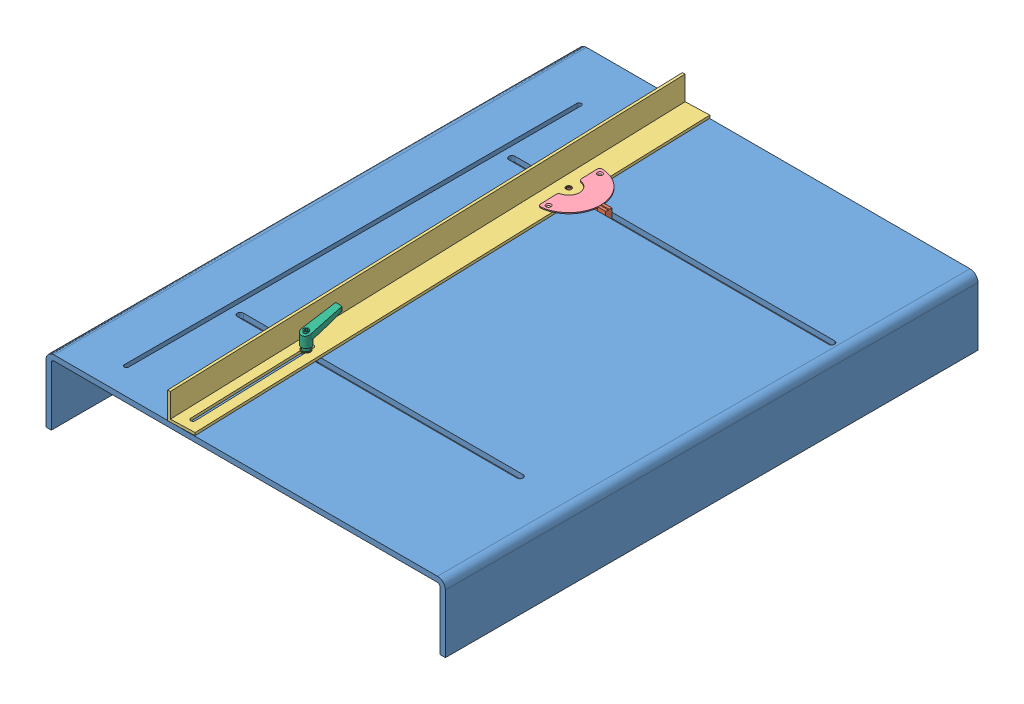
SolidWorks assembly Baugruppe f. Forum.SLDASM, configuration Standard (file format 4400). Lengths in mm.
Overall size (750 184.61 1001.1).
7 component instances, 7 part files, 20 mates.
Components (placement in the parent):
- Tischplatte-1: Tischplatte.SLDPRT [Standard] at (-425.3848 -43.7019 0) size (750 125 1000)
- Nutenstein lang-1: Nutenstein lang.SLDPRT [Standard] at (-213.7372 64.2981 259) x (0 0 -1) z (1 0 0) size (18 24 95)
- Anschlag 2-1: Anschlag 2.SLDPRT [Standard] at (-196.5215 81.2981 1000.4988) x (0.999458 0 -0.032934) z (0.032934 0 0.999458) size (50 50 1000)
- Skala-1: Skala.SLDPRT [Standard] at (-193.7372 86.2981 250) x (-0.032934 0 -0.999458) z (0 1 0) size (119.54 60 2)
- Nutenstein kurz-1: Nutenstein kurz.SLDPRT [Standard] at (-191.9315 65.2981 769) x (0 0 -1) z (1 0 0) size (18 16 30)
- Klemmhebel-1: Klemmhebel.SLDPRT [Standard] at (-176.9315 87.8981 760) x (0.998301 0 0.058264) z (-0.058264 0 0.998301) size (37.75 78.01 70.8)
- Plain Washer Grade A_DIN-1: Plain Washer Grade A_DIN.sldprt [Washer DIN 125 - A 8.4] at (-176.9315 87.8981 760) x (0 1 0) z (0 0 1) size (1.6 16 16)
Mates (geometry in assembly coordinates):
- Deckungsgleich2: coincident anti-aligned: plane of Tischplatte-1 through (-415.3848 71.2981 1000) normal (0 -1 0); plane of Nutenstein lang-1 through (-118.7372 71.2981 241) normal (0 1 0)
- Deckungsgleich33: coincident anti-aligned: plane of Anschlag 2-1 through (-224.4586 86.2981 0.8766) normal (0 1 0); plane of Skala-1 through (-189.5466 86.2981 225.3537) normal (0 -1 0)
- Konzentrisch12: concentric anti-aligned: cylinder of Anschlag 2-1 through (-193.7372 86.2981 250) axis (0 1 0) radius 5; cylinder of Skala-1 through (-193.7372 88.2981 250) axis (0 -1 0) radius 20
- Parallel1: parallel anti-aligned: plane of Anschlag 2-1 through (-224.4586 131.2981 0.8766) normal (0.999458 0 -0.032934); plane of Skala-1 through (-194.5439 88.2981 225.5184) normal (-0.999458 0 0.032934)
- Deckungsgleich35: coincident anti-aligned: plane of Tischplatte-1 through (-300.3848 -540.31 244.25) normal (0 0 1); plane of Nutenstein lang-1 through (-118.7372 71.2981 244.25) normal (0 0 -1)
- Deckungsgleich36: coincident anti-aligned: plane of Tischplatte-1 through (-425.3848 81.2981 1000) normal (0 1 0); plane of Anschlag 2-1 through (-179.483 81.2981 -0.6054) normal (0 -1 0)
- Konzentrisch13: concentric aligned: cylinder of Nutenstein lang-1 through (-193.7372 80.2981 250) axis (0 1 0) radius 5; cylinder of Anschlag 2-1 through (-193.7372 86.2981 250) axis (0 1 0) radius 5
- Deckungsgleich43: coincident anti-aligned: plane of Tischplatte-1 through (-415.3848 71.2981 1000) normal (0 -1 0); plane of Nutenstein kurz-1 through (-161.9315 71.2981 751) normal (0 1 0)
- Deckungsgleich44: coincident anti-aligned: plane of Tischplatte-1 through (-300.3848 -43.7029 754.25) normal (0 0 1); plane of Nutenstein kurz-1 through (-161.9315 71.2981 754.25) normal (0 0 -1)
- Konzentrisch14: concentric aligned: cylinder of Nutenstein kurz-1 through (-176.9315 79.2981 760) axis (0 1 0) radius 3.4; cylinder of Klemmhebel-1 through (-176.9315 62.8981 760) axis (0 1 0) radius 4
- Konzentrisch15: concentric anti-aligned: cylinder of Klemmhebel-1 through (-176.9315 62.8981 760) axis (0 1 0) radius 4; cylinder of Plain Washer Grade A_DIN-1 through (-176.9315 52.9731 760) axis (0 -1 0) radius 4.2
- Deckungsgleich47: coincident anti-aligned: plane of Klemmhebel-1 through (-176.9315 87.8981 760) normal (0 -1 0); plane of Plain Washer Grade A_DIN-1 through (-181.1315 87.8981 760) normal (0 1 0)
- Deckungsgleich48: coincident anti-aligned: plane of Anschlag 2-1 through (-224.4586 86.2981 0.8766) normal (0 1 0); plane of Plain Washer Grade A_DIN-1 through (-184.9315 86.2981 760) normal (0 -1 0)
- Abstand6: distance = 0.25 mm anti-aligned: plane of Anschlag 2-1; cylinder of Klemmhebel-1 through (-220.2752 62.8981 760) axis (0 1 0) radius 4
- LimitAbstand4: limit distance = 195.3831 mm: line of ? through (-223.2679 65.1481 250) axis (0 1 0)
- LimitAbstand5: limit distance = 182.3904 mm: line of ? through (-220.2752 66.1481 760) axis (0 1 0)
- Deckungsgleich49: coincident: curve of Tischplatte-1; point of Anschlag 2-1
- Tangential1: tangent anti-aligned: plane of Anschlag 2-1; cylinder of Klemmhebel-1 through (-40.6925 62.8981 760) axis (0 1 0) radius 4
- Deckungsgleich52: coincident: curve of Anschlag 2-1; point of Nutenstein kurz-1
- Deckungsgleich53: coincident = 5.75 mm: curve of Tischplatte-1; point of Nutenstein kurz-1; sketch_entity of Tischplatte-1; sketch_entity of Tischplatte-1; sketch_entity of Tischplatte-1
